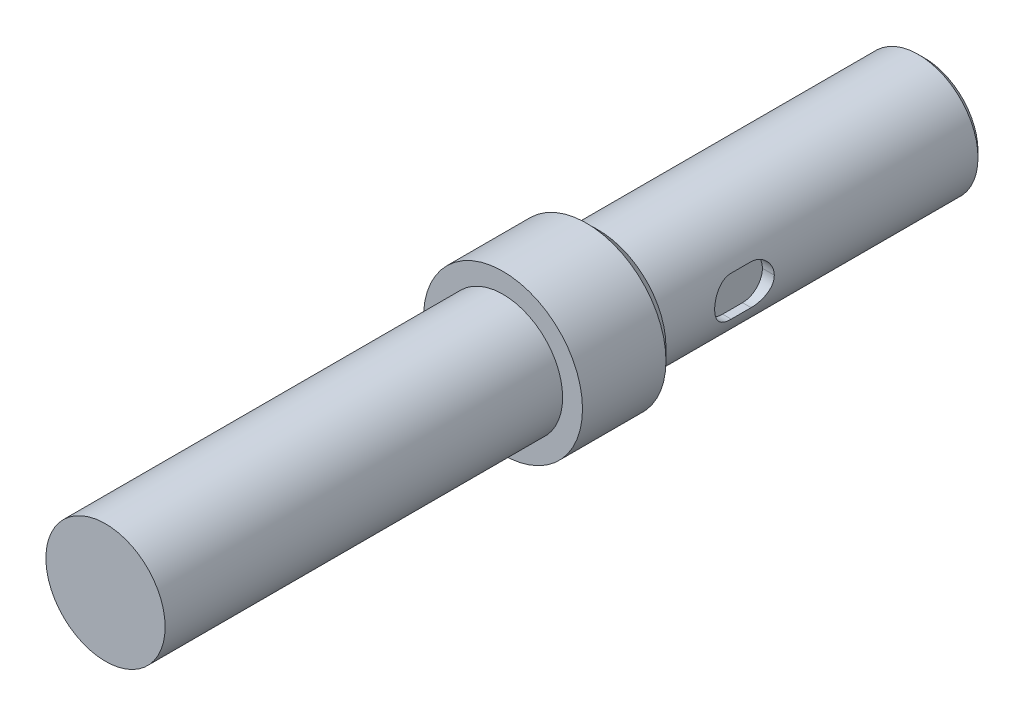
ISO-10303-21;
HEADER;
FILE_DESCRIPTION(('STEP AP214'),'2;1');
FILE_NAME('part.step','',(''),(''),'','','');
FILE_SCHEMA(('AUTOMOTIVE_DESIGN { 1 0 10303 214 1 1 1 1 }'));
ENDSEC;
DATA;
#1=APPLICATION_CONTEXT('core data for automotive mechanical design processes');
#2=APPLICATION_PROTOCOL_DEFINITION('international standard','automotive_design',2000,#1);
#3=PRODUCT_CONTEXT('',#1,'mechanical');
#4=PRODUCT('Part','Part','',(#3));
#5=PRODUCT_RELATED_PRODUCT_CATEGORY('part','',(#4));
#6=PRODUCT_DEFINITION_FORMATION('','',#4);
#7=PRODUCT_DEFINITION_CONTEXT('part definition',#1,'design');
#8=PRODUCT_DEFINITION('design','',#6,#7);
#9=PRODUCT_DEFINITION_SHAPE('','',#8);
#10=(LENGTH_UNIT() NAMED_UNIT(*) SI_UNIT(.MILLI.,.METRE.));
#11=(NAMED_UNIT(*) PLANE_ANGLE_UNIT() SI_UNIT($,.RADIAN.));
#12=(NAMED_UNIT(*) SI_UNIT($,.STERADIAN.) SOLID_ANGLE_UNIT());
#13=UNCERTAINTY_MEASURE_WITH_UNIT(LENGTH_MEASURE(1.E-05),#10,'distance_accuracy_value','');
#14=(GEOMETRIC_REPRESENTATION_CONTEXT(3) GLOBAL_UNCERTAINTY_ASSIGNED_CONTEXT((#13)) GLOBAL_UNIT_ASSIGNED_CONTEXT((#10,
#11,#12)) REPRESENTATION_CONTEXT('',''));
#15=CARTESIAN_POINT('',(0.,0.,0.));
#16=DIRECTION('',(0.,0.,1.));
#17=DIRECTION('',(1.,0.,0.));
#18=AXIS2_PLACEMENT_3D('',#15,#16,#17);
#19=CARTESIAN_POINT('',(0.,0.,42.));
#20=DIRECTION('',(0.,0.,-1.));
#21=DIRECTION('',(-1.,0.,0.));
#22=AXIS2_PLACEMENT_3D('',#19,#20,#21);
#23=CYLINDRICAL_SURFACE('',#22,15.);
#24=DIRECTION('',(0.,0.,-1.));
#25=VECTOR('',#24,1.);
#26=CARTESIAN_POINT('',(14.1311567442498,5.03094514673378,42.));
#27=LINE('',#26,#25);
#28=CARTESIAN_POINT('',(14.1311567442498,5.03094514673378,17.7464323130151));
#29=VERTEX_POINT('',#28);
#30=CARTESIAN_POINT('',(14.1311567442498,5.03094514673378,22.7464323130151));
#31=VERTEX_POINT('',#30);
#32=EDGE_CURVE('E95',#29,#31,#27,.F.);
#33=ORIENTED_EDGE('',*,*,#32,.F.);
#34=CARTESIAN_POINT('',(14.1311567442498,5.03094514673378,17.7464323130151));
#35=CARTESIAN_POINT('',(14.1311343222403,5.03096449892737,17.6100776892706));
#36=CARTESIAN_POINT('',(14.1331417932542,5.02536823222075,17.4737317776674));
#37=CARTESIAN_POINT('',(14.1410522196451,5.00308892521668,17.2020985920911));
#38=CARTESIAN_POINT('',(14.1469541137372,4.98640890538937,17.0668110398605));
#39=CARTESIAN_POINT('',(14.1624655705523,4.94217394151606,16.7986697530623));
#40=CARTESIAN_POINT('',(14.1720637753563,4.91465230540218,16.6658098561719));
#41=CARTESIAN_POINT('',(14.1946623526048,4.84899705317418,16.4030351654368));
#42=CARTESIAN_POINT('',(14.207662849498,4.81086304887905,16.2731204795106));
#43=CARTESIAN_POINT('',(14.2366650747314,4.72434586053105,16.0172085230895));
#44=CARTESIAN_POINT('',(14.2526643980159,4.67597088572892,15.8912082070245));
#45=CARTESIAN_POINT('',(14.2872039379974,4.56934767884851,15.6437977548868));
#46=CARTESIAN_POINT('',(14.3057450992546,4.51109577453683,15.5223893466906));
#47=CARTESIAN_POINT('',(14.3644219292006,4.32213221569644,15.1661430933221));
#48=CARTESIAN_POINT('',(14.4076225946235,4.17717958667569,14.9391868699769));
#49=CARTESIAN_POINT('',(14.4992288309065,3.84740550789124,14.5042494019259));
#50=CARTESIAN_POINT('',(14.5477651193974,3.66134602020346,14.2972341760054));
#51=CARTESIAN_POINT('',(14.6195436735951,3.35853577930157,14.0119380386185));
#52=CARTESIAN_POINT('',(14.6433131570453,3.25357378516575,13.9209957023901));
#53=CARTESIAN_POINT('',(14.6898948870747,3.03633128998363,13.7480698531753));
#54=CARTESIAN_POINT('',(14.7127074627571,2.92405333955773,13.666083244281));
#55=CARTESIAN_POINT('',(14.7573825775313,2.68966232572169,13.5094951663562));
#56=CARTESIAN_POINT('',(14.7792016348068,2.56736353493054,13.4351593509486));
#57=CARTESIAN_POINT('',(14.8205780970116,2.31659385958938,13.2971305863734));
#58=CARTESIAN_POINT('',(14.8401363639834,2.18812535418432,13.2334335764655));
#59=CARTESIAN_POINT('',(14.8764350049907,1.92592205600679,13.117220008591));
#60=CARTESIAN_POINT('',(14.8931770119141,1.79219037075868,13.0646969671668));
#61=CARTESIAN_POINT('',(14.9233713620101,1.52042838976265,12.9712778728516));
#62=CARTESIAN_POINT('',(14.9368245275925,1.38239917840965,12.9303789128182));
#63=CARTESIAN_POINT('',(14.9648488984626,1.04519332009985,12.8461618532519));
#64=CARTESIAN_POINT('',(14.9775861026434,0.844311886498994,12.8088240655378));
#65=CARTESIAN_POINT('',(14.9905995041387,0.540605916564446,12.7714260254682));
#66=CARTESIAN_POINT('',(14.993921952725,0.438954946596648,12.7620614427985));
#67=CARTESIAN_POINT('',(14.9985024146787,0.235196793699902,12.749563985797));
#68=CARTESIAN_POINT('',(14.9997598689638,0.133089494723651,12.7464327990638));
#69=CARTESIAN_POINT('',(14.9999680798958,0.0309451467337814,12.7464323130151));
#70=B_SPLINE_CURVE_WITH_KNOTS('',3,(#34,#35,#36,#37,#38,#39,#40,#41,#42,#43,#44,#45,#46,#47,#48,
#49,#50,#51,#52,#53,#54,#55,#56,#57,#58,#59,#60,#61,#62,#63,#64,#65,#66,#67,#68,#69),
.UNSPECIFIED.,.F.,.F.,(4,2,2,2,2,2,2,2,2,2,2,2,2,2,2,2,2,4),(0.,0.408920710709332,
0.817730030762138,1.22529306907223,1.63287101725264,2.04012347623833,2.44752768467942,
3.26202935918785,4.1055938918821,4.52789505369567,4.95004976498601,5.3838335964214,
5.81745147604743,6.25081706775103,6.68407418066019,7.29631236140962,7.60254071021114,
7.90885195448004),.UNSPECIFIED.);
#71=CARTESIAN_POINT('',(14.9999680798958,0.0309451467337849,12.7464323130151));
#72=VERTEX_POINT('',#71);
#73=EDGE_CURVE('E12',#29,#72,#70,.T.);
#74=ORIENTED_EDGE('',*,*,#73,.T.);
#75=CARTESIAN_POINT('',(14.9999680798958,0.0309451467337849,12.7464323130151));
#76=CARTESIAN_POINT('',(15.0002679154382,-0.105629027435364,12.746413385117));
#77=CARTESIAN_POINT('',(14.9986669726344,-0.242200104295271,12.7520272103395));
#78=CARTESIAN_POINT('',(14.9917931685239,-0.514305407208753,12.774382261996));
#79=CARTESIAN_POINT('',(14.9865211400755,-0.649839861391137,12.7911209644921));
#80=CARTESIAN_POINT('',(14.9724543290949,-0.918531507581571,12.8355262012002));
#81=CARTESIAN_POINT('',(14.9636693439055,-1.05169424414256,12.8631623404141));
#82=CARTESIAN_POINT('',(14.9428239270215,-1.31508843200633,12.9291070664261));
#83=CARTESIAN_POINT('',(14.9307634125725,-1.44531980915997,12.9674159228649));
#84=CARTESIAN_POINT('',(14.9036979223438,-1.70188797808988,13.0543511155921));
#85=CARTESIAN_POINT('',(14.8886946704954,-1.82822700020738,13.102971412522));
#86=CARTESIAN_POINT('',(14.8561290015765,-2.07631711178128,13.2101656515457));
#87=CARTESIAN_POINT('',(14.8385656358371,-2.19806647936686,13.2687432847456));
#88=CARTESIAN_POINT('',(14.801332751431,-2.43619976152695,13.3954117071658));
#89=CARTESIAN_POINT('',(14.7816629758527,-2.55258301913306,13.4635036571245));
#90=CARTESIAN_POINT('',(14.7407197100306,-2.77929475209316,13.6087157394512));
#91=CARTESIAN_POINT('',(14.7194456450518,-2.88962103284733,13.6858391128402));
#92=CARTESIAN_POINT('',(14.6526877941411,-3.21701743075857,13.9349572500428));
#93=CARTESIAN_POINT('',(14.6054324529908,-3.42335125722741,14.1209018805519));
#94=CARTESIAN_POINT('',(14.5113414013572,-3.80253833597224,14.5244621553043));
#95=CARTESIAN_POINT('',(14.4645058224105,-3.97538142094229,14.7420873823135));
#96=CARTESIAN_POINT('',(14.3977923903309,-4.20836820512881,15.0915018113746));
#97=CARTESIAN_POINT('',(14.3758531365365,-4.28252540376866,15.2137563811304));
#98=CARTESIAN_POINT('',(14.3341133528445,-4.42022267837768,15.4644312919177));
#99=CARTESIAN_POINT('',(14.3143120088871,-4.48376680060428,15.5928492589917));
#100=CARTESIAN_POINT('',(14.2774877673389,-4.59967888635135,15.854915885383));
#101=CARTESIAN_POINT('',(14.2604629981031,-4.65205438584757,15.9885609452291));
#102=CARTESIAN_POINT('',(14.229738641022,-4.74520109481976,16.260145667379));
#103=CARTESIAN_POINT('',(14.2160382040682,-4.78597526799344,16.3980842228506));
#104=CARTESIAN_POINT('',(14.1875858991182,-4.86982114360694,16.7346935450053));
#105=CARTESIAN_POINT('',(14.1747098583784,-4.90696885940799,16.9350571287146));
#106=CARTESIAN_POINT('',(14.1617518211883,-4.9441815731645,17.2379987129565));
#107=CARTESIAN_POINT('',(14.1584917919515,-4.95350101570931,17.3394057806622));
#108=CARTESIAN_POINT('',(14.1541329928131,-4.96593837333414,17.5426742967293));
#109=CARTESIAN_POINT('',(14.1530348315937,-4.96905454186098,17.6445358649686));
#110=CARTESIAN_POINT('',(14.1530383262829,-4.96905485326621,17.7464323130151));
#111=B_SPLINE_CURVE_WITH_KNOTS('',3,(#75,#76,#77,#78,#79,#80,#81,#82,#83,#84,#85,#86,#87,#88,
#89,#90,#91,#92,#93,#94,#95,#96,#97,#98,#99,#100,#101,#102,#103,#104,#105,#106,#107,#108,#109,
#110),.UNSPECIFIED.,.F.,.F.,(4,2,2,2,2,2,2,2,2,2,2,2,2,2,2,2,2,4),(0.,0.409584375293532,
0.819075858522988,1.22743318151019,1.63580082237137,2.04392994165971,2.4522106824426,
2.86054127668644,3.26901885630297,4.11023242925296,4.95170098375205,5.38523059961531,
5.8185945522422,6.25166516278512,6.68462504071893,7.29526295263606,7.60074374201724,
7.906310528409),.UNSPECIFIED.);
#112=CARTESIAN_POINT('',(14.1530383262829,-4.9690548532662,17.7464323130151));
#113=VERTEX_POINT('',#112);
#114=EDGE_CURVE('E46',#72,#113,#111,.T.);
#115=ORIENTED_EDGE('',*,*,#114,.T.);
#116=DIRECTION('',(0.,0.,-1.));
#117=VECTOR('',#116,1.);
#118=CARTESIAN_POINT('',(14.1530383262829,-4.9690548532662,42.));
#119=LINE('',#118,#117);
#120=CARTESIAN_POINT('',(14.1530383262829,-4.9690548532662,22.7464323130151));
#121=VERTEX_POINT('',#120);
#122=EDGE_CURVE('E102',#113,#121,#119,.F.);
#123=ORIENTED_EDGE('',*,*,#122,.T.);
#124=CARTESIAN_POINT('',(14.1530383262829,-4.96905485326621,22.7464323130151));
#125=CARTESIAN_POINT('',(14.1530160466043,-4.96907410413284,22.88291065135));
#126=CARTESIAN_POINT('',(14.1549994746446,-4.96346780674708,23.0193804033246));
#127=CARTESIAN_POINT('',(14.1628145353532,-4.94114777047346,23.2912621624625));
#128=CARTESIAN_POINT('',(14.1686451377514,-4.92443700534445,23.4266744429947));
#129=CARTESIAN_POINT('',(14.1839684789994,-4.8801181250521,23.695071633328));
#130=CARTESIAN_POINT('',(14.1934501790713,-4.85254285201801,23.8280626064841));
#131=CARTESIAN_POINT('',(14.2157719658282,-4.78675676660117,24.0910984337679));
#132=CARTESIAN_POINT('',(14.2286121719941,-4.74854557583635,24.2211431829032));
#133=CARTESIAN_POINT('',(14.2572525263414,-4.66184827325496,24.4773154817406));
#134=CARTESIAN_POINT('',(14.2730503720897,-4.61337015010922,24.6034459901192));
#135=CARTESIAN_POINT('',(14.3071473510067,-4.50651461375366,24.8511110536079));
#136=CARTESIAN_POINT('',(14.3254474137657,-4.44813351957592,24.9726438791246));
#137=CARTESIAN_POINT('',(14.3833436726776,-4.25874404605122,25.3292463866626));
#138=CARTESIAN_POINT('',(14.4259479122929,-4.11345495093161,25.5564214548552));
#139=CARTESIAN_POINT('',(14.5161599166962,-3.78302643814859,25.9915573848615));
#140=CARTESIAN_POINT('',(14.5638903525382,-3.59667407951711,26.1985719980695));
#141=CARTESIAN_POINT('',(14.634354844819,-3.29340072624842,26.4838190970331));
#142=CARTESIAN_POINT('',(14.657668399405,-3.18828053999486,26.5747368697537));
#143=CARTESIAN_POINT('',(14.7033047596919,-2.97071736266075,26.7475945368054));
#144=CARTESIAN_POINT('',(14.7256279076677,-2.85827693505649,26.8295375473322));
#145=CARTESIAN_POINT('',(14.7692498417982,-2.62371140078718,26.9859122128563));
#146=CARTESIAN_POINT('',(14.7905064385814,-2.50140969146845,27.0600906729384));
#147=CARTESIAN_POINT('',(14.8307338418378,-2.25065557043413,27.1978085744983));
#148=CARTESIAN_POINT('',(14.8497055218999,-2.12220553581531,27.2613520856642));
#149=CARTESIAN_POINT('',(14.8848121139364,-1.86006278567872,27.3772646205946));
#150=CARTESIAN_POINT('',(14.9009486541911,-1.72637313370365,27.4296400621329));
#151=CARTESIAN_POINT('',(14.9299184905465,-1.45472186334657,27.5227724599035));
#152=CARTESIAN_POINT('',(14.9427526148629,-1.31676132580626,27.5635323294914));
#153=CARTESIAN_POINT('',(14.9692400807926,-0.980175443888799,27.6473246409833));
#154=CARTESIAN_POINT('',(14.9810708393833,-0.779874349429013,27.6844337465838));
#155=CARTESIAN_POINT('',(14.9927531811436,-0.477088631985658,27.72159850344));
#156=CARTESIAN_POINT('',(14.9956366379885,-0.375754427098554,27.7309036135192));
#157=CARTESIAN_POINT('',(14.999350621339,-0.17264261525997,27.7433211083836));
#158=CARTESIAN_POINT('',(15.0001805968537,-0.070864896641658,27.7464318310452));
#159=CARTESIAN_POINT('',(14.9999680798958,0.0309451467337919,27.7464323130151));
#160=B_SPLINE_CURVE_WITH_KNOTS('',3,(#124,#125,#126,#127,#128,#129,#130,#131,#132,#133,#134,
#135,#136,#137,#138,#139,#140,#141,#142,#143,#144,#145,#146,#147,#148,#149,#150,#151,#152,#153,
#154,#155,#156,#157,#158,#159),.UNSPECIFIED.,.F.,.F.,(4,2,2,2,2,2,2,2,2,2,2,2,2,2,2,2,2,4),(0.,
0.409292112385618,0.818474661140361,1.22642967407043,1.63439920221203,2.04205244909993,
2.44985755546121,3.26514842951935,4.10886903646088,4.53124651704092,4.95347687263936,
5.38677497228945,5.81990688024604,6.25278921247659,6.68556287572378,7.29582037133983,
7.60104811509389,7.90635774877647),.UNSPECIFIED.);
#161=CARTESIAN_POINT('',(14.9999680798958,0.0309451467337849,27.7464323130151));
#162=VERTEX_POINT('',#161);
#163=EDGE_CURVE('E59',#121,#162,#160,.T.);
#164=ORIENTED_EDGE('',*,*,#163,.T.);
#165=CARTESIAN_POINT('',(14.9999680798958,0.0309451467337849,27.7464323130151));
#166=CARTESIAN_POINT('',(14.9997042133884,0.167630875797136,27.7464512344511));
#167=CARTESIAN_POINT('',(14.9975364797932,0.304305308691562,27.7408282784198));
#168=CARTESIAN_POINT('',(14.9895275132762,0.576599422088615,27.7184406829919));
#169=CARTESIAN_POINT('',(14.9836871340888,0.712219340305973,27.7016786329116));
#170=CARTESIAN_POINT('',(14.9684881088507,0.98106094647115,27.6572169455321));
#171=CARTESIAN_POINT('',(14.9591393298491,1.11428827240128,27.6295479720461));
#172=CARTESIAN_POINT('',(14.9371734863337,1.37779519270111,27.563531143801));
#173=CARTESIAN_POINT('',(14.9245563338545,1.50807470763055,27.5251830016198));
#174=CARTESIAN_POINT('',(14.8963894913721,1.76472074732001,27.4381667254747));
#175=CARTESIAN_POINT('',(14.8808415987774,1.89108961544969,27.3895049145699));
#176=CARTESIAN_POINT('',(14.8472014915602,2.13922724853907,27.2822262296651));
#177=CARTESIAN_POINT('',(14.8291083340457,2.26099428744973,27.2236056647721));
#178=CARTESIAN_POINT('',(14.7908339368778,2.4991548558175,27.0968500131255));
#179=CARTESIAN_POINT('',(14.7706524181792,2.61554766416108,27.0287136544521));
#180=CARTESIAN_POINT('',(14.7287070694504,2.84227148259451,26.8834117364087));
#181=CARTESIAN_POINT('',(14.7069426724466,2.95260029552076,26.8062429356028));
#182=CARTESIAN_POINT('',(14.6386962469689,3.28011854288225,26.5568906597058));
#183=CARTESIAN_POINT('',(14.5904791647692,3.48654861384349,26.3707342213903));
#184=CARTESIAN_POINT('',(14.4945994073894,3.86587986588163,25.9666941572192));
#185=CARTESIAN_POINT('',(14.4469369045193,4.03877087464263,25.7488009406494));
#186=CARTESIAN_POINT('',(14.3791125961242,4.27175895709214,25.3989701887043));
#187=CARTESIAN_POINT('',(14.3568234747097,4.34589541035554,25.2765921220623));
#188=CARTESIAN_POINT('',(14.3144357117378,4.48353813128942,25.0256576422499));
#189=CARTESIAN_POINT('',(14.294336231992,4.5470484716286,24.8971036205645));
#190=CARTESIAN_POINT('',(14.2569736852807,4.66287563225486,24.6347556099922));
#191=CARTESIAN_POINT('',(14.2397086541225,4.71520021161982,24.5009653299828));
#192=CARTESIAN_POINT('',(14.2085665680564,4.80822547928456,24.22908139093));
#193=CARTESIAN_POINT('',(14.1946886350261,4.84892918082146,24.0909888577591));
#194=CARTESIAN_POINT('',(14.1659618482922,4.93236739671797,23.7548507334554));
#195=CARTESIAN_POINT('',(14.1529891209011,4.96926898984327,23.5551395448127));
#196=CARTESIAN_POINT('',(14.1399345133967,5.0062357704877,23.2531913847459));
#197=CARTESIAN_POINT('',(14.1366503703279,5.01549377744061,23.1521175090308));
#198=CARTESIAN_POINT('',(14.132259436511,5.02784920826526,22.9495181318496));
#199=CARTESIAN_POINT('',(14.1311532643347,5.03094488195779,22.847992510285));
#200=CARTESIAN_POINT('',(14.1311567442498,5.03094514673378,22.7464323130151));
#201=B_SPLINE_CURVE_WITH_KNOTS('',3,(#165,#166,#167,#168,#169,#170,#171,#172,#173,#174,#175,
#176,#177,#178,#179,#180,#181,#182,#183,#184,#185,#186,#187,#188,#189,#190,#191,#192,#193,#194,
#195,#196,#197,#198,#199,#200),.UNSPECIFIED.,.F.,.F.,(4,2,2,2,2,2,2,2,2,2,2,2,2,2,2,2,2,4),(0.,
0.409917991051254,0.819740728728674,1.22841941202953,1.63710909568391,2.04554894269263,
2.4541404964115,2.86278671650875,3.27158003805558,4.11390710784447,4.95648925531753,
5.39045909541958,5.82426222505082,6.25776346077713,6.69115218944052,7.29976858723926,
7.60424113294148,7.90880014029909),.UNSPECIFIED.);
#202=EDGE_CURVE('E106',#162,#31,#201,.T.);
#203=ORIENTED_EDGE('',*,*,#202,.T.);
#204=EDGE_LOOP('',(#33,#74,#115,#123,#164,#203));
#205=FACE_BOUND('',#204,.T.);
#206=CARTESIAN_POINT('',(0.,0.,-38.5));
#207=DIRECTION('',(0.,0.,1.));
#208=DIRECTION('',(1.,0.,0.));
#209=AXIS2_PLACEMENT_3D('',#206,#207,#208);
#210=CIRCLE('',#209,15.);
#211=CARTESIAN_POINT('',(15.,0.,-38.5));
#212=VERTEX_POINT('',#211);
#213=EDGE_CURVE('E180',#212,#212,#210,.T.);
#214=ORIENTED_EDGE('',*,*,#213,.T.);
#215=EDGE_LOOP('',(#214));
#216=FACE_BOUND('',#215,.T.);
#217=CARTESIAN_POINT('',(0.,0.,42.));
#218=DIRECTION('',(0.,0.,1.));
#219=DIRECTION('',(1.,0.,0.));
#220=AXIS2_PLACEMENT_3D('',#217,#218,#219);
#221=CIRCLE('',#220,15.);
#222=CARTESIAN_POINT('',(15.,0.,42.));
#223=VERTEX_POINT('',#222);
#224=EDGE_CURVE('E189',#223,#223,#221,.T.);
#225=ORIENTED_EDGE('',*,*,#224,.F.);
#226=EDGE_LOOP('',(#225));
#227=FACE_BOUND('',#226,.T.);
#228=ADVANCED_FACE('F36',(#205,#216,#227),#23,.T.);
#229=CARTESIAN_POINT('',(0.,0.,66.));
#230=DIRECTION('',(0.,0.,-1.));
#231=DIRECTION('',(-1.,0.,0.));
#232=AXIS2_PLACEMENT_3D('',#229,#230,#231);
#233=CYLINDRICAL_SURFACE('',#232,20.);
#234=CARTESIAN_POINT('',(0.,0.,45.));
#235=DIRECTION('',(0.,0.,1.));
#236=DIRECTION('',(1.,0.,0.));
#237=AXIS2_PLACEMENT_3D('',#234,#235,#236);
#238=CIRCLE('',#237,20.);
#239=CARTESIAN_POINT('',(20.,0.,45.));
#240=VERTEX_POINT('',#239);
#241=EDGE_CURVE('E186',#240,#240,#238,.T.);
#242=ORIENTED_EDGE('',*,*,#241,.T.);
#243=EDGE_LOOP('',(#242));
#244=FACE_BOUND('',#243,.T.);
#245=CARTESIAN_POINT('',(0.,0.,66.));
#246=DIRECTION('',(0.,0.,1.));
#247=DIRECTION('',(1.,0.,0.));
#248=AXIS2_PLACEMENT_3D('',#245,#246,#247);
#249=CIRCLE('',#248,20.);
#250=CARTESIAN_POINT('',(20.,0.,66.));
#251=VERTEX_POINT('',#250);
#252=EDGE_CURVE('E192',#251,#251,#249,.T.);
#253=ORIENTED_EDGE('',*,*,#252,.F.);
#254=EDGE_LOOP('',(#253));
#255=FACE_BOUND('',#254,.T.);
#256=ADVANCED_FACE('F216',(#244,#255),#233,.T.);
#257=CARTESIAN_POINT('',(0.,0.,66.));
#258=DIRECTION('',(0.,0.,1.));
#259=DIRECTION('',(1.,0.,0.));
#260=AXIS2_PLACEMENT_3D('',#257,#258,#259);
#261=PLANE('',#260);
#262=CARTESIAN_POINT('',(0.,0.,66.));
#263=DIRECTION('',(0.,0.,1.));
#264=DIRECTION('',(1.,0.,0.));
#265=AXIS2_PLACEMENT_3D('',#262,#263,#264);
#266=CIRCLE('',#265,15.);
#267=CARTESIAN_POINT('',(15.,0.,66.));
#268=VERTEX_POINT('',#267);
#269=EDGE_CURVE('E168',#268,#268,#266,.T.);
#270=ORIENTED_EDGE('',*,*,#269,.F.);
#271=EDGE_LOOP('',(#270));
#272=FACE_BOUND('',#271,.T.);
#273=ORIENTED_EDGE('',*,*,#252,.T.);
#274=EDGE_LOOP('',(#273));
#275=FACE_BOUND('',#274,.T.);
#276=ADVANCED_FACE('F220',(#272,#275),#261,.T.);
#277=CARTESIAN_POINT('',(0.,0.,42.));
#278=DIRECTION('',(0.,0.,1.));
#279=DIRECTION('',(1.,0.,0.));
#280=AXIS2_PLACEMENT_3D('',#277,#278,#279);
#281=PLANE('',#280);
#282=CARTESIAN_POINT('',(0.,0.,42.));
#283=DIRECTION('',(0.,0.,1.));
#284=DIRECTION('',(1.,0.,0.));
#285=AXIS2_PLACEMENT_3D('',#282,#283,#284);
#286=CIRCLE('',#285,17.);
#287=CARTESIAN_POINT('',(17.,0.,42.));
#288=VERTEX_POINT('',#287);
#289=EDGE_CURVE('E183',#288,#288,#286,.F.);
#290=ORIENTED_EDGE('',*,*,#289,.T.);
#291=EDGE_LOOP('',(#290));
#292=FACE_BOUND('',#291,.T.);
#293=ORIENTED_EDGE('',*,*,#224,.T.);
#294=EDGE_LOOP('',(#293));
#295=FACE_BOUND('',#294,.T.);
#296=ADVANCED_FACE('F212',(#292,#295),#281,.F.);
#297=CARTESIAN_POINT('',(0.,0.,45.));
#298=DIRECTION('',(0.,0.,1.));
#299=DIRECTION('',(1.,0.,0.));
#300=AXIS2_PLACEMENT_3D('',#297,#298,#299);
#301=CONICAL_SURFACE('',#300,20.,0.785398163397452);
#302=ORIENTED_EDGE('',*,*,#289,.F.);
#303=EDGE_LOOP('',(#302));
#304=FACE_BOUND('',#303,.T.);
#305=ORIENTED_EDGE('',*,*,#241,.F.);
#306=EDGE_LOOP('',(#305));
#307=FACE_BOUND('',#306,.T.);
#308=ADVANCED_FACE('F204',(#304,#307),#301,.T.);
#309=CARTESIAN_POINT('',(0.,0.,166.));
#310=DIRECTION('',(0.,0.,-1.));
#311=DIRECTION('',(-1.,0.,0.));
#312=AXIS2_PLACEMENT_3D('',#309,#310,#311);
#313=CYLINDRICAL_SURFACE('',#312,15.);
#314=CARTESIAN_POINT('',(0.,0.,166.));
#315=DIRECTION('',(0.,0.,1.));
#316=DIRECTION('',(1.,0.,0.));
#317=AXIS2_PLACEMENT_3D('',#314,#315,#316);
#318=CIRCLE('',#317,15.);
#319=CARTESIAN_POINT('',(15.,0.,166.));
#320=VERTEX_POINT('',#319);
#321=EDGE_CURVE('E173',#320,#320,#318,.T.);
#322=ORIENTED_EDGE('',*,*,#321,.F.);
#323=EDGE_LOOP('',(#322));
#324=FACE_BOUND('',#323,.T.);
#325=ORIENTED_EDGE('',*,*,#269,.T.);
#326=EDGE_LOOP('',(#325));
#327=FACE_BOUND('',#326,.T.);
#328=ADVANCED_FACE('F202',(#324,#327),#313,.T.);
#329=CARTESIAN_POINT('',(0.,0.,166.));
#330=DIRECTION('',(0.,0.,1.));
#331=DIRECTION('',(1.,0.,0.));
#332=AXIS2_PLACEMENT_3D('',#329,#330,#331);
#333=PLANE('',#332);
#334=ORIENTED_EDGE('',*,*,#321,.T.);
#335=EDGE_LOOP('',(#334));
#336=FACE_BOUND('',#335,.T.);
#337=ADVANCED_FACE('F200',(#336),#333,.T.);
#338=CARTESIAN_POINT('',(0.,0.,-40.));
#339=DIRECTION('',(0.,0.,1.));
#340=DIRECTION('',(1.,0.,0.));
#341=AXIS2_PLACEMENT_3D('',#338,#339,#340);
#342=PLANE('',#341);
#343=CARTESIAN_POINT('',(0.,0.,-40.));
#344=DIRECTION('',(0.,0.,1.));
#345=DIRECTION('',(1.,0.,0.));
#346=AXIS2_PLACEMENT_3D('',#343,#344,#345);
#347=CIRCLE('',#346,13.5);
#348=CARTESIAN_POINT('',(13.5,0.,-40.));
#349=VERTEX_POINT('',#348);
#350=EDGE_CURVE('E107',#349,#349,#347,.F.);
#351=ORIENTED_EDGE('',*,*,#350,.T.);
#352=EDGE_LOOP('',(#351));
#353=FACE_BOUND('',#352,.T.);
#354=ADVANCED_FACE('F210',(#353),#342,.F.);
#355=CARTESIAN_POINT('',(0.,0.,-38.5));
#356=DIRECTION('',(0.,0.,1.));
#357=DIRECTION('',(1.,0.,0.));
#358=AXIS2_PLACEMENT_3D('',#355,#356,#357);
#359=CONICAL_SURFACE('',#358,15.,0.785398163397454);
#360=ORIENTED_EDGE('',*,*,#350,.F.);
#361=EDGE_LOOP('',(#360));
#362=FACE_BOUND('',#361,.T.);
#363=ORIENTED_EDGE('',*,*,#213,.F.);
#364=EDGE_LOOP('',(#363));
#365=FACE_BOUND('',#364,.T.);
#366=ADVANCED_FACE('F149',(#362,#365),#359,.T.);
#367=CARTESIAN_POINT('',(15.,-4.96905485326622,12.7464323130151));
#368=DIRECTION('',(0.,-1.,0.));
#369=DIRECTION('',(0.,0.,-1.));
#370=AXIS2_PLACEMENT_3D('',#367,#368,#369);
#371=PLANE('',#370);
#372=DIRECTION('',(0.,0.,1.));
#373=VECTOR('',#372,1.);
#374=CARTESIAN_POINT('',(12.,-4.96905485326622,12.7464323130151));
#375=LINE('',#374,#373);
#376=CARTESIAN_POINT('',(12.,-4.96905485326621,17.7464323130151));
#377=VERTEX_POINT('',#376);
#378=CARTESIAN_POINT('',(12.,-4.96905485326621,22.7464323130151));
#379=VERTEX_POINT('',#378);
#380=EDGE_CURVE('E164',#377,#379,#375,.T.);
#381=ORIENTED_EDGE('',*,*,#380,.T.);
#382=DIRECTION('',(-1.,0.,0.));
#383=VECTOR('',#382,1.);
#384=CARTESIAN_POINT('',(15.,-4.96905485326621,22.7464323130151));
#385=LINE('',#384,#383);
#386=EDGE_CURVE('E154',#379,#121,#385,.F.);
#387=ORIENTED_EDGE('',*,*,#386,.T.);
#388=ORIENTED_EDGE('',*,*,#122,.F.);
#389=DIRECTION('',(-1.,0.,0.));
#390=VECTOR('',#389,1.);
#391=CARTESIAN_POINT('',(12.,-4.96905485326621,17.7464323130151));
#392=LINE('',#391,#390);
#393=EDGE_CURVE('E117',#113,#377,#392,.T.);
#394=ORIENTED_EDGE('',*,*,#393,.T.);
#395=EDGE_LOOP('',(#381,#387,#388,#394));
#396=FACE_BOUND('',#395,.T.);
#397=ADVANCED_FACE('F277',(#396),#371,.F.);
#398=CARTESIAN_POINT('',(15.,5.03094514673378,12.7464323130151));
#399=DIRECTION('',(0.,-1.,0.));
#400=DIRECTION('',(0.,0.,-1.));
#401=AXIS2_PLACEMENT_3D('',#398,#399,#400);
#402=PLANE('',#401);
#403=ORIENTED_EDGE('',*,*,#32,.T.);
#404=DIRECTION('',(-1.,0.,0.));
#405=VECTOR('',#404,1.);
#406=CARTESIAN_POINT('',(12.,5.03094514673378,22.7464323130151));
#407=LINE('',#406,#405);
#408=CARTESIAN_POINT('',(12.,5.03094514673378,22.7464323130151));
#409=VERTEX_POINT('',#408);
#410=EDGE_CURVE('E101',#31,#409,#407,.T.);
#411=ORIENTED_EDGE('',*,*,#410,.T.);
#412=DIRECTION('',(0.,0.,1.));
#413=VECTOR('',#412,1.);
#414=CARTESIAN_POINT('',(12.,5.03094514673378,12.7464323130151));
#415=LINE('',#414,#413);
#416=CARTESIAN_POINT('',(12.,5.03094514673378,17.7464323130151));
#417=VERTEX_POINT('',#416);
#418=EDGE_CURVE('E98',#417,#409,#415,.T.);
#419=ORIENTED_EDGE('',*,*,#418,.F.);
#420=DIRECTION('',(-1.,0.,0.));
#421=VECTOR('',#420,1.);
#422=CARTESIAN_POINT('',(15.,5.03094514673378,17.7464323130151));
#423=LINE('',#422,#421);
#424=EDGE_CURVE('E92',#417,#29,#423,.F.);
#425=ORIENTED_EDGE('',*,*,#424,.T.);
#426=EDGE_LOOP('',(#403,#411,#419,#425));
#427=FACE_BOUND('',#426,.T.);
#428=ADVANCED_FACE('F93',(#427),#402,.T.);
#429=CARTESIAN_POINT('',(12.,0.,0.));
#430=DIRECTION('',(-1.,0.,0.));
#431=DIRECTION('',(0.,0.,1.));
#432=AXIS2_PLACEMENT_3D('',#429,#430,#431);
#433=PLANE('',#432);
#434=ORIENTED_EDGE('',*,*,#418,.T.);
#435=CARTESIAN_POINT('',(12.,0.0309451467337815,22.7464323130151));
#436=DIRECTION('',(-1.,0.,0.));
#437=DIRECTION('',(0.,0.,1.));
#438=AXIS2_PLACEMENT_3D('',#435,#436,#437);
#439=CIRCLE('',#438,5.);
#440=CARTESIAN_POINT('',(12.,0.0309451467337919,27.7464323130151));
#441=VERTEX_POINT('',#440);
#442=EDGE_CURVE('E157',#409,#441,#439,.F.);
#443=ORIENTED_EDGE('',*,*,#442,.T.);
#444=CARTESIAN_POINT('',(12.,0.0309451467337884,22.7464323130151));
#445=DIRECTION('',(-1.,0.,0.));
#446=DIRECTION('',(0.,0.,1.));
#447=AXIS2_PLACEMENT_3D('',#444,#445,#446);
#448=CIRCLE('',#447,5.);
#449=EDGE_CURVE('E159',#441,#379,#448,.F.);
#450=ORIENTED_EDGE('',*,*,#449,.T.);
#451=ORIENTED_EDGE('',*,*,#380,.F.);
#452=CARTESIAN_POINT('',(12.,0.0309451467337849,17.7464323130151));
#453=DIRECTION('',(-1.,0.,0.));
#454=DIRECTION('',(0.,0.,1.));
#455=AXIS2_PLACEMENT_3D('',#452,#453,#454);
#456=CIRCLE('',#455,5.);
#457=CARTESIAN_POINT('',(12.,0.0309451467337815,12.7464323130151));
#458=VERTEX_POINT('',#457);
#459=EDGE_CURVE('E161',#377,#458,#456,.F.);
#460=ORIENTED_EDGE('',*,*,#459,.T.);
#461=CARTESIAN_POINT('',(12.,0.0309451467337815,17.7464323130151));
#462=DIRECTION('',(-1.,0.,0.));
#463=DIRECTION('',(0.,0.,1.));
#464=AXIS2_PLACEMENT_3D('',#461,#462,#463);
#465=CIRCLE('',#464,5.);
#466=EDGE_CURVE('E111',#458,#417,#465,.F.);
#467=ORIENTED_EDGE('',*,*,#466,.T.);
#468=EDGE_LOOP('',(#434,#443,#450,#451,#460,#467));
#469=FACE_BOUND('',#468,.T.);
#470=ADVANCED_FACE('F143',(#469),#433,.F.);
#471=CARTESIAN_POINT('',(15.,0.0309451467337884,22.7464323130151));
#472=DIRECTION('',(-1.,0.,0.));
#473=DIRECTION('',(0.,0.,1.));
#474=AXIS2_PLACEMENT_3D('',#471,#472,#473);
#475=CYLINDRICAL_SURFACE('',#474,5.);
#476=DIRECTION('',(-1.,0.,0.));
#477=VECTOR('',#476,1.);
#478=CARTESIAN_POINT('',(15.,0.0309451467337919,27.7464323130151));
#479=LINE('',#478,#477);
#480=EDGE_CURVE('E113',#162,#441,#479,.T.);
#481=ORIENTED_EDGE('',*,*,#480,.F.);
#482=ORIENTED_EDGE('',*,*,#163,.F.);
#483=ORIENTED_EDGE('',*,*,#386,.F.);
#484=ORIENTED_EDGE('',*,*,#449,.F.);
#485=EDGE_LOOP('',(#481,#482,#483,#484));
#486=FACE_BOUND('',#485,.T.);
#487=ADVANCED_FACE('F138',(#486),#475,.F.);
#488=CARTESIAN_POINT('',(15.,0.0309451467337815,22.7464323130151));
#489=DIRECTION('',(1.,0.,0.));
#490=DIRECTION('',(0.,0.,-1.));
#491=AXIS2_PLACEMENT_3D('',#488,#489,#490);
#492=CYLINDRICAL_SURFACE('',#491,5.);
#493=ORIENTED_EDGE('',*,*,#202,.F.);
#494=ORIENTED_EDGE('',*,*,#480,.T.);
#495=ORIENTED_EDGE('',*,*,#442,.F.);
#496=ORIENTED_EDGE('',*,*,#410,.F.);
#497=EDGE_LOOP('',(#493,#494,#495,#496));
#498=FACE_BOUND('',#497,.T.);
#499=ADVANCED_FACE('F142',(#498),#492,.F.);
#500=CARTESIAN_POINT('',(15.,0.0309451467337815,17.7464323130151));
#501=DIRECTION('',(-1.,0.,0.));
#502=DIRECTION('',(0.,0.,1.));
#503=AXIS2_PLACEMENT_3D('',#500,#501,#502);
#504=CYLINDRICAL_SURFACE('',#503,5.);
#505=DIRECTION('',(-1.,0.,0.));
#506=VECTOR('',#505,1.);
#507=CARTESIAN_POINT('',(15.,0.0309451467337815,12.7464323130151));
#508=LINE('',#507,#506);
#509=EDGE_CURVE('E41',#72,#458,#508,.T.);
#510=ORIENTED_EDGE('',*,*,#509,.F.);
#511=ORIENTED_EDGE('',*,*,#73,.F.);
#512=ORIENTED_EDGE('',*,*,#424,.F.);
#513=ORIENTED_EDGE('',*,*,#466,.F.);
#514=EDGE_LOOP('',(#510,#511,#512,#513));
#515=FACE_BOUND('',#514,.T.);
#516=ADVANCED_FACE('F38',(#515),#504,.F.);
#517=CARTESIAN_POINT('',(15.,0.0309451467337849,17.7464323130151));
#518=DIRECTION('',(1.,0.,0.));
#519=DIRECTION('',(0.,0.,-1.));
#520=AXIS2_PLACEMENT_3D('',#517,#518,#519);
#521=CYLINDRICAL_SURFACE('',#520,5.);
#522=ORIENTED_EDGE('',*,*,#114,.F.);
#523=ORIENTED_EDGE('',*,*,#509,.T.);
#524=ORIENTED_EDGE('',*,*,#459,.F.);
#525=ORIENTED_EDGE('',*,*,#393,.F.);
#526=EDGE_LOOP('',(#522,#523,#524,#525));
#527=FACE_BOUND('',#526,.T.);
#528=ADVANCED_FACE('F115',(#527),#521,.F.);
#529=CLOSED_SHELL('',(#228,#256,#276,#296,#308,#328,#337,#354,#366,#397,#428,#470,#487,#499,
#516,#528));
#530=MANIFOLD_SOLID_BREP('B2',#529);
#531=ADVANCED_BREP_SHAPE_REPRESENTATION('',(#18,#530),#14);
#532=SHAPE_DEFINITION_REPRESENTATION(#9,#531);
ENDSEC;
END-ISO-10303-21;
